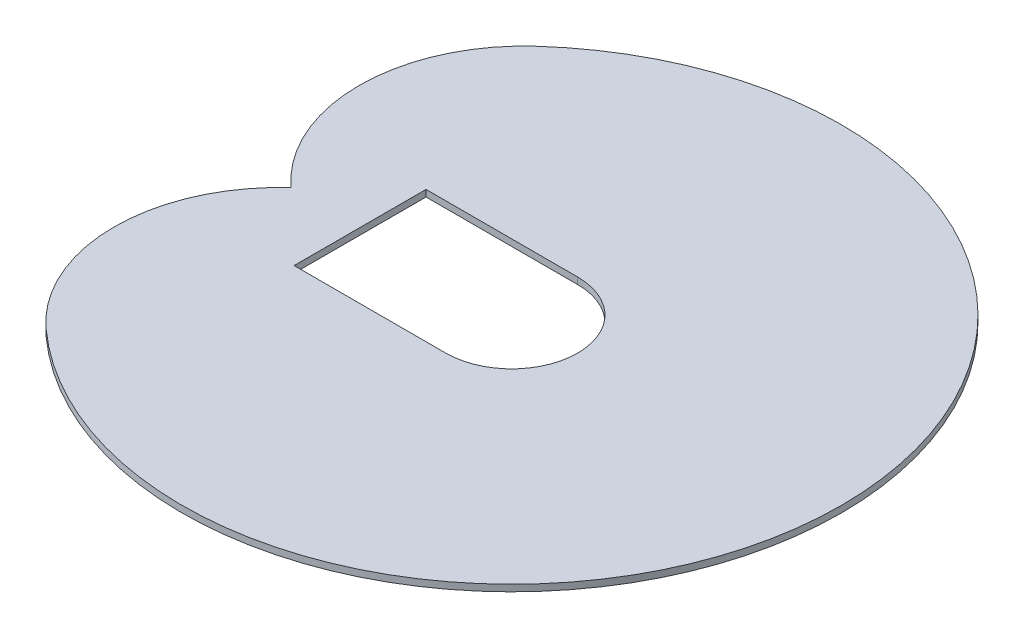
ISO-10303-21;
HEADER;
FILE_DESCRIPTION(('STEP AP214'),'2;1');
FILE_NAME('part.step','',(''),(''),'','','');
FILE_SCHEMA(('AUTOMOTIVE_DESIGN { 1 0 10303 214 1 1 1 1 }'));
ENDSEC;
DATA;
#1=APPLICATION_CONTEXT('core data for automotive mechanical design processes');
#2=APPLICATION_PROTOCOL_DEFINITION('international standard','automotive_design',2000,#1);
#3=PRODUCT_CONTEXT('',#1,'mechanical');
#4=PRODUCT('Part','Part','',(#3));
#5=PRODUCT_RELATED_PRODUCT_CATEGORY('part','',(#4));
#6=PRODUCT_DEFINITION_FORMATION('','',#4);
#7=PRODUCT_DEFINITION_CONTEXT('part definition',#1,'design');
#8=PRODUCT_DEFINITION('design','',#6,#7);
#9=PRODUCT_DEFINITION_SHAPE('','',#8);
#10=(LENGTH_UNIT() NAMED_UNIT(*) SI_UNIT(.MILLI.,.METRE.));
#11=(NAMED_UNIT(*) PLANE_ANGLE_UNIT() SI_UNIT($,.RADIAN.));
#12=(NAMED_UNIT(*) SI_UNIT($,.STERADIAN.) SOLID_ANGLE_UNIT());
#13=UNCERTAINTY_MEASURE_WITH_UNIT(LENGTH_MEASURE(1.E-05),#10,'distance_accuracy_value','');
#14=(GEOMETRIC_REPRESENTATION_CONTEXT(3) GLOBAL_UNCERTAINTY_ASSIGNED_CONTEXT((#13)) GLOBAL_UNIT_ASSIGNED_CONTEXT((#10,
#11,#12)) REPRESENTATION_CONTEXT('',''));
#15=CARTESIAN_POINT('',(0.,0.,0.));
#16=DIRECTION('',(0.,0.,1.));
#17=DIRECTION('',(1.,0.,0.));
#18=AXIS2_PLACEMENT_3D('',#15,#16,#17);
#19=CARTESIAN_POINT('',(-83.6413257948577,10.,92.8931031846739));
#20=DIRECTION('',(0.,1.,0.));
#21=DIRECTION('',(0.,0.,1.));
#22=AXIS2_PLACEMENT_3D('',#19,#20,#21);
#23=PLANE('',#22);
#24=CARTESIAN_POINT('',(-167.282651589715,10.,185.786206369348));
#25=DIRECTION('',(0.,1.,0.));
#26=DIRECTION('',(0.,0.,1.));
#27=AXIS2_PLACEMENT_3D('',#24,#25,#26);
#28=CIRCLE('',#27,250.);
#29=CARTESIAN_POINT('',(-334.565303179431,10.,0.));
#30=VERTEX_POINT('',#29);
#31=CARTESIAN_POINT('',(-334.565303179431,10.,371.572412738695));
#32=VERTEX_POINT('',#31);
#33=EDGE_CURVE('E130',#30,#32,#28,.T.);
#34=ORIENTED_EDGE('',*,*,#33,.T.);
#35=CARTESIAN_POINT('',(0.,10.,0.));
#36=DIRECTION('',(0.,1.,0.));
#37=DIRECTION('',(0.,0.,1.));
#38=AXIS2_PLACEMENT_3D('',#35,#36,#37);
#39=CIRCLE('',#38,500.);
#40=CARTESIAN_POINT('',(-334.565303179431,10.,-371.572412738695));
#41=VERTEX_POINT('',#40);
#42=EDGE_CURVE('E133',#32,#41,#39,.T.);
#43=ORIENTED_EDGE('',*,*,#42,.T.);
#44=CARTESIAN_POINT('',(-167.282651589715,10.,-185.786206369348));
#45=DIRECTION('',(0.,1.,0.));
#46=DIRECTION('',(0.,0.,1.));
#47=AXIS2_PLACEMENT_3D('',#44,#45,#46);
#48=CIRCLE('',#47,250.);
#49=EDGE_CURVE('E136',#41,#30,#48,.T.);
#50=ORIENTED_EDGE('',*,*,#49,.T.);
#51=EDGE_LOOP('',(#34,#43,#50));
#52=FACE_BOUND('',#51,.T.);
#53=DIRECTION('',(-1.,0.,0.));
#54=VECTOR('',#53,1.);
#55=CARTESIAN_POINT('',(0.,10.,-100.));
#56=LINE('',#55,#54);
#57=CARTESIAN_POINT('',(0.,10.,-100.));
#58=VERTEX_POINT('',#57);
#59=CARTESIAN_POINT('',(-230.,10.,-100.));
#60=VERTEX_POINT('',#59);
#61=EDGE_CURVE('E102',#58,#60,#56,.T.);
#62=ORIENTED_EDGE('',*,*,#61,.F.);
#63=CARTESIAN_POINT('',(0.,10.,0.));
#64=DIRECTION('',(0.,1.,0.));
#65=DIRECTION('',(0.,0.,1.));
#66=AXIS2_PLACEMENT_3D('',#63,#64,#65);
#67=CIRCLE('',#66,100.);
#68=CARTESIAN_POINT('',(0.,10.,100.));
#69=VERTEX_POINT('',#68);
#70=EDGE_CURVE('E94',#69,#58,#67,.T.);
#71=ORIENTED_EDGE('',*,*,#70,.F.);
#72=DIRECTION('',(1.,0.,0.));
#73=VECTOR('',#72,1.);
#74=CARTESIAN_POINT('',(0.,10.,100.));
#75=LINE('',#74,#73);
#76=CARTESIAN_POINT('',(-230.,10.,100.));
#77=VERTEX_POINT('',#76);
#78=EDGE_CURVE('E116',#77,#69,#75,.T.);
#79=ORIENTED_EDGE('',*,*,#78,.F.);
#80=DIRECTION('',(0.,0.,1.));
#81=VECTOR('',#80,1.);
#82=CARTESIAN_POINT('',(-230.,10.,-100.));
#83=LINE('',#82,#81);
#84=EDGE_CURVE('E114',#60,#77,#83,.T.);
#85=ORIENTED_EDGE('',*,*,#84,.F.);
#86=EDGE_LOOP('',(#62,#71,#79,#85));
#87=FACE_BOUND('',#86,.T.);
#88=ADVANCED_FACE('F35',(#52,#87),#23,.T.);
#89=CARTESIAN_POINT('',(-83.6413257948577,0.,92.8931031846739));
#90=DIRECTION('',(0.,1.,0.));
#91=DIRECTION('',(0.,0.,1.));
#92=AXIS2_PLACEMENT_3D('',#89,#90,#91);
#93=PLANE('',#92);
#94=CARTESIAN_POINT('',(-167.282651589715,0.,185.786206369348));
#95=DIRECTION('',(0.,1.,0.));
#96=DIRECTION('',(0.,0.,1.));
#97=AXIS2_PLACEMENT_3D('',#94,#95,#96);
#98=CIRCLE('',#97,250.);
#99=CARTESIAN_POINT('',(-334.565303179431,0.,0.));
#100=VERTEX_POINT('',#99);
#101=CARTESIAN_POINT('',(-334.565303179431,0.,371.572412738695));
#102=VERTEX_POINT('',#101);
#103=EDGE_CURVE('E110',#100,#102,#98,.T.);
#104=ORIENTED_EDGE('',*,*,#103,.F.);
#105=CARTESIAN_POINT('',(-167.282651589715,0.,-185.786206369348));
#106=DIRECTION('',(0.,1.,0.));
#107=DIRECTION('',(0.,0.,1.));
#108=AXIS2_PLACEMENT_3D('',#105,#106,#107);
#109=CIRCLE('',#108,250.);
#110=CARTESIAN_POINT('',(-334.565303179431,0.,-371.572412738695));
#111=VERTEX_POINT('',#110);
#112=EDGE_CURVE('E134',#111,#100,#109,.T.);
#113=ORIENTED_EDGE('',*,*,#112,.F.);
#114=CARTESIAN_POINT('',(0.,0.,0.));
#115=DIRECTION('',(0.,1.,0.));
#116=DIRECTION('',(0.,0.,1.));
#117=AXIS2_PLACEMENT_3D('',#114,#115,#116);
#118=CIRCLE('',#117,500.);
#119=EDGE_CURVE('E141',#102,#111,#118,.T.);
#120=ORIENTED_EDGE('',*,*,#119,.F.);
#121=EDGE_LOOP('',(#104,#113,#120));
#122=FACE_BOUND('',#121,.T.);
#123=CARTESIAN_POINT('',(0.,0.,0.));
#124=DIRECTION('',(0.,1.,0.));
#125=DIRECTION('',(0.,0.,1.));
#126=AXIS2_PLACEMENT_3D('',#123,#124,#125);
#127=CIRCLE('',#126,100.);
#128=CARTESIAN_POINT('',(0.,0.,100.));
#129=VERTEX_POINT('',#128);
#130=CARTESIAN_POINT('',(0.,0.,-100.));
#131=VERTEX_POINT('',#130);
#132=EDGE_CURVE('E58',#129,#131,#127,.T.);
#133=ORIENTED_EDGE('',*,*,#132,.T.);
#134=DIRECTION('',(-1.,0.,0.));
#135=VECTOR('',#134,1.);
#136=CARTESIAN_POINT('',(0.,0.,-100.));
#137=LINE('',#136,#135);
#138=CARTESIAN_POINT('',(-230.,0.,-100.));
#139=VERTEX_POINT('',#138);
#140=EDGE_CURVE('E109',#131,#139,#137,.T.);
#141=ORIENTED_EDGE('',*,*,#140,.T.);
#142=DIRECTION('',(0.,0.,1.));
#143=VECTOR('',#142,1.);
#144=CARTESIAN_POINT('',(-230.,0.,-100.));
#145=LINE('',#144,#143);
#146=CARTESIAN_POINT('',(-230.,0.,100.));
#147=VERTEX_POINT('',#146);
#148=EDGE_CURVE('E122',#139,#147,#145,.T.);
#149=ORIENTED_EDGE('',*,*,#148,.T.);
#150=DIRECTION('',(1.,0.,0.));
#151=VECTOR('',#150,1.);
#152=CARTESIAN_POINT('',(0.,0.,100.));
#153=LINE('',#152,#151);
#154=EDGE_CURVE('E103',#147,#129,#153,.T.);
#155=ORIENTED_EDGE('',*,*,#154,.T.);
#156=EDGE_LOOP('',(#133,#141,#149,#155));
#157=FACE_BOUND('',#156,.T.);
#158=ADVANCED_FACE('F155',(#122,#157),#93,.F.);
#159=CARTESIAN_POINT('',(-167.282651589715,10.,185.786206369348));
#160=DIRECTION('',(0.,-1.,0.));
#161=DIRECTION('',(0.,0.,-1.));
#162=AXIS2_PLACEMENT_3D('',#159,#160,#161);
#163=CYLINDRICAL_SURFACE('',#162,250.);
#164=ORIENTED_EDGE('',*,*,#103,.T.);
#165=DIRECTION('',(0.,-1.,0.));
#166=VECTOR('',#165,1.);
#167=CARTESIAN_POINT('',(-334.565303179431,10.,371.572412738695));
#168=LINE('',#167,#166);
#169=EDGE_CURVE('E11',#32,#102,#168,.T.);
#170=ORIENTED_EDGE('',*,*,#169,.F.);
#171=ORIENTED_EDGE('',*,*,#33,.F.);
#172=DIRECTION('',(0.,-1.,0.));
#173=VECTOR('',#172,1.);
#174=CARTESIAN_POINT('',(-334.565303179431,10.,0.));
#175=LINE('',#174,#173);
#176=EDGE_CURVE('E138',#30,#100,#175,.T.);
#177=ORIENTED_EDGE('',*,*,#176,.T.);
#178=EDGE_LOOP('',(#164,#170,#171,#177));
#179=FACE_BOUND('',#178,.T.);
#180=ADVANCED_FACE('F37',(#179),#163,.T.);
#181=CARTESIAN_POINT('',(0.,10.,0.));
#182=DIRECTION('',(0.,-1.,0.));
#183=DIRECTION('',(0.,0.,-1.));
#184=AXIS2_PLACEMENT_3D('',#181,#182,#183);
#185=CYLINDRICAL_SURFACE('',#184,500.);
#186=ORIENTED_EDGE('',*,*,#119,.T.);
#187=DIRECTION('',(0.,-1.,0.));
#188=VECTOR('',#187,1.);
#189=CARTESIAN_POINT('',(-334.565303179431,10.,-371.572412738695));
#190=LINE('',#189,#188);
#191=EDGE_CURVE('E43',#41,#111,#190,.T.);
#192=ORIENTED_EDGE('',*,*,#191,.F.);
#193=ORIENTED_EDGE('',*,*,#42,.F.);
#194=ORIENTED_EDGE('',*,*,#169,.T.);
#195=EDGE_LOOP('',(#186,#192,#193,#194));
#196=FACE_BOUND('',#195,.T.);
#197=ADVANCED_FACE('F161',(#196),#185,.T.);
#198=CARTESIAN_POINT('',(-167.282651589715,10.,-185.786206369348));
#199=DIRECTION('',(0.,-1.,0.));
#200=DIRECTION('',(0.,0.,-1.));
#201=AXIS2_PLACEMENT_3D('',#198,#199,#200);
#202=CYLINDRICAL_SURFACE('',#201,250.);
#203=ORIENTED_EDGE('',*,*,#112,.T.);
#204=ORIENTED_EDGE('',*,*,#176,.F.);
#205=ORIENTED_EDGE('',*,*,#49,.F.);
#206=ORIENTED_EDGE('',*,*,#191,.T.);
#207=EDGE_LOOP('',(#203,#204,#205,#206));
#208=FACE_BOUND('',#207,.T.);
#209=ADVANCED_FACE('F150',(#208),#202,.T.);
#210=CARTESIAN_POINT('',(0.,10.,0.));
#211=DIRECTION('',(0.,-1.,0.));
#212=DIRECTION('',(0.,0.,-1.));
#213=AXIS2_PLACEMENT_3D('',#210,#211,#212);
#214=CYLINDRICAL_SURFACE('',#213,100.);
#215=ORIENTED_EDGE('',*,*,#132,.F.);
#216=DIRECTION('',(0.,-1.,0.));
#217=VECTOR('',#216,1.);
#218=CARTESIAN_POINT('',(0.,10.,100.));
#219=LINE('',#218,#217);
#220=EDGE_CURVE('E98',#69,#129,#219,.T.);
#221=ORIENTED_EDGE('',*,*,#220,.F.);
#222=ORIENTED_EDGE('',*,*,#70,.T.);
#223=DIRECTION('',(0.,-1.,0.));
#224=VECTOR('',#223,1.);
#225=CARTESIAN_POINT('',(0.,10.,-100.));
#226=LINE('',#225,#224);
#227=EDGE_CURVE('E97',#58,#131,#226,.T.);
#228=ORIENTED_EDGE('',*,*,#227,.T.);
#229=EDGE_LOOP('',(#215,#221,#222,#228));
#230=FACE_BOUND('',#229,.T.);
#231=ADVANCED_FACE('F96',(#230),#214,.F.);
#232=CARTESIAN_POINT('',(0.,10.,-100.));
#233=DIRECTION('',(0.,0.,1.));
#234=DIRECTION('',(1.,0.,0.));
#235=AXIS2_PLACEMENT_3D('',#232,#233,#234);
#236=PLANE('',#235);
#237=ORIENTED_EDGE('',*,*,#140,.F.);
#238=ORIENTED_EDGE('',*,*,#227,.F.);
#239=ORIENTED_EDGE('',*,*,#61,.T.);
#240=DIRECTION('',(0.,-1.,0.));
#241=VECTOR('',#240,1.);
#242=CARTESIAN_POINT('',(-230.,10.,-100.));
#243=LINE('',#242,#241);
#244=EDGE_CURVE('E111',#60,#139,#243,.T.);
#245=ORIENTED_EDGE('',*,*,#244,.T.);
#246=EDGE_LOOP('',(#237,#238,#239,#245));
#247=FACE_BOUND('',#246,.T.);
#248=ADVANCED_FACE('F106',(#247),#236,.T.);
#249=CARTESIAN_POINT('',(-230.,10.,-100.));
#250=DIRECTION('',(1.,0.,0.));
#251=DIRECTION('',(0.,0.,-1.));
#252=AXIS2_PLACEMENT_3D('',#249,#250,#251);
#253=PLANE('',#252);
#254=ORIENTED_EDGE('',*,*,#148,.F.);
#255=ORIENTED_EDGE('',*,*,#244,.F.);
#256=ORIENTED_EDGE('',*,*,#84,.T.);
#257=DIRECTION('',(0.,-1.,0.));
#258=VECTOR('',#257,1.);
#259=CARTESIAN_POINT('',(-230.,10.,100.));
#260=LINE('',#259,#258);
#261=EDGE_CURVE('E50',#77,#147,#260,.T.);
#262=ORIENTED_EDGE('',*,*,#261,.T.);
#263=EDGE_LOOP('',(#254,#255,#256,#262));
#264=FACE_BOUND('',#263,.T.);
#265=ADVANCED_FACE('F179',(#264),#253,.T.);
#266=CARTESIAN_POINT('',(0.,10.,100.));
#267=DIRECTION('',(0.,0.,-1.));
#268=DIRECTION('',(-1.,0.,0.));
#269=AXIS2_PLACEMENT_3D('',#266,#267,#268);
#270=PLANE('',#269);
#271=ORIENTED_EDGE('',*,*,#154,.F.);
#272=ORIENTED_EDGE('',*,*,#261,.F.);
#273=ORIENTED_EDGE('',*,*,#78,.T.);
#274=ORIENTED_EDGE('',*,*,#220,.T.);
#275=EDGE_LOOP('',(#271,#272,#273,#274));
#276=FACE_BOUND('',#275,.T.);
#277=ADVANCED_FACE('F182',(#276),#270,.T.);
#278=CLOSED_SHELL('',(#88,#158,#180,#197,#209,#231,#248,#265,#277));
#279=MANIFOLD_SOLID_BREP('B2',#278);
#280=ADVANCED_BREP_SHAPE_REPRESENTATION('',(#18,#279),#14);
#281=SHAPE_DEFINITION_REPRESENTATION(#9,#280);
ENDSEC;
END-ISO-10303-21;
